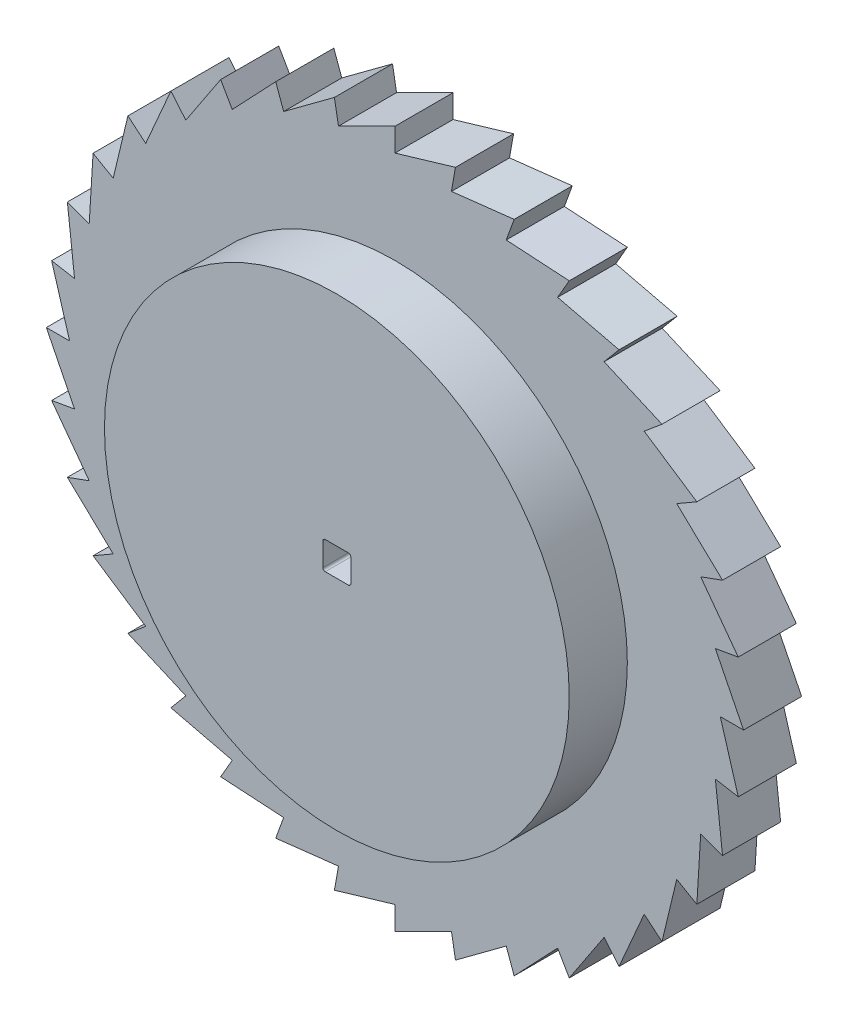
from build123d import *

# Parameters (mm, degrees)
BOSS_EXTRUDE1_DEPTH = 6.35
SKETCH2_R           = 25.4
BOSS_EXTRUDE2_DEPTH = 6.35
SKETCH3_W           = 3.048
SKETCH3_H           = 3.048
CUT_EXTRUDE1_DEPTH  = 56.358016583
FILLET1_R           = 0.254


with BuildPart() as part:
    # Sketch1 → Boss-Extrude1 (new body)
    with BuildSketch(Plane.XY):
        Polygon((6.174929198, 35.019763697), (13.030967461, 35.802288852), (12.162236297, 33.415469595), (19.05, 32.995567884), (17.78, 30.795863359), (24.490207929, 29.186293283), (22.8575274, 27.240540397), (29.186293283, 24.490207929), (27.240540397, 22.8575274), (32.995567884, 19.05), (30.795863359, 17.78), (35.802288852, 13.030967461), (33.415469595, 12.162236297), (37.52117539, 6.615995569), (35.019763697, 6.174929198), (38.1, 0), (35.56, 0), (37.52117539, -6.615995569), (35.019763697, -6.174929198), (35.802288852, -13.030967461), (33.415469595, -12.162236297), (32.995567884, -19.05), (30.795863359, -17.78), (29.186293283, -24.490207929), (27.240540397, -22.8575274), (24.490207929, -29.186293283), (22.8575274, -27.240540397), (19.05, -32.995567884), (17.78, -30.795863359), (13.030967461, -35.802288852), (12.162236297, -33.415469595), (6.615995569, -37.52117539), (6.174929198, -35.019763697), (0, -38.1), (0, -35.56), (-6.615995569, -37.52117539), (-6.174929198, -35.019763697), (-13.030967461, -35.802288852), (-12.162236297, -33.415469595), (-19.05, -32.995567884), (-17.78, -30.795863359), (-24.490207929, -29.186293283), (-22.8575274, -27.240540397), (-29.186293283, -24.490207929), (-27.240540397, -22.8575274), (-32.995567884, -19.05), (-30.795863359, -17.78), (-35.802288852, -13.030967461), (-33.415469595, -12.162236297), (-37.52117539, -6.615995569), (-35.019763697, -6.174929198), (-38.1, 0), (-35.56, 0), (-37.52117539, 6.615995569), (-35.019763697, 6.174929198), (-35.802288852, 13.030967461), (-33.415469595, 12.162236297), (-32.995567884, 19.05), (-30.795863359, 17.78), (-29.186293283, 24.490207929), (-27.240540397, 22.8575274), (-24.490207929, 29.186293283), (-22.8575274, 27.240540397), (-19.05, 32.995567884), (-17.78, 30.795863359), (-13.030967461, 35.802288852), (-12.162236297, 33.415469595), (-6.615995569, 37.52117539), (-6.174929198, 35.019763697), (0, 38.1), (0, 35.56), (6.615995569, 37.52117539), align=None)
    extrude(amount=BOSS_EXTRUDE1_DEPTH)

    # Sketch2 → Boss-Extrude2 (add)
    with BuildSketch(Plane.XY.offset(6.35)):
        Circle(SKETCH2_R)
    extrude(amount=BOSS_EXTRUDE2_DEPTH)

    # Sketch3 → Cut-Extrude1 (cut, through all)
    with BuildSketch(Plane(origin=(0, 0, 0), x_dir=(-1, 0, 0), z_dir=(0, 0, -1))):
        Rectangle(SKETCH3_W, SKETCH3_H)
    extrude(amount=-CUT_EXTRUDE1_DEPTH, mode=Mode.SUBTRACT)

    # Fillet1
    fillet1_edges = [part.edges().sort_by_distance(p)[0] for p in [
        (-1.524, 1.524, 6.35),
        (-1.524, -1.524, 6.35),
        (1.524, -1.524, 6.35),
        (1.524, 1.524, 6.35),
    ]]
    fillet(fillet1_edges, radius=FILLET1_R)


solid = part.part
